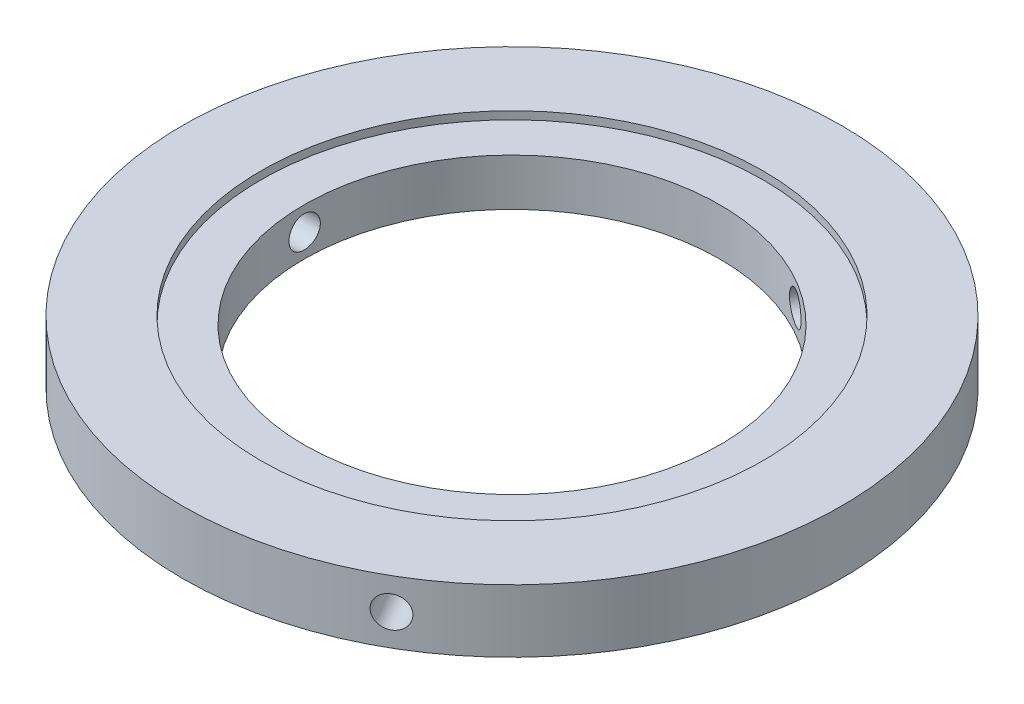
ISO-10303-21;
HEADER;
FILE_DESCRIPTION(('STEP AP214'),'2;1');
FILE_NAME('part.step','',(''),(''),'','','');
FILE_SCHEMA(('AUTOMOTIVE_DESIGN { 1 0 10303 214 1 1 1 1 }'));
ENDSEC;
DATA;
#1=APPLICATION_CONTEXT('core data for automotive mechanical design processes');
#2=APPLICATION_PROTOCOL_DEFINITION('international standard','automotive_design',2000,#1);
#3=PRODUCT_CONTEXT('',#1,'mechanical');
#4=PRODUCT('Part','Part','',(#3));
#5=PRODUCT_RELATED_PRODUCT_CATEGORY('part','',(#4));
#6=PRODUCT_DEFINITION_FORMATION('','',#4);
#7=PRODUCT_DEFINITION_CONTEXT('part definition',#1,'design');
#8=PRODUCT_DEFINITION('design','',#6,#7);
#9=PRODUCT_DEFINITION_SHAPE('','',#8);
#10=(LENGTH_UNIT() NAMED_UNIT(*) SI_UNIT(.MILLI.,.METRE.));
#11=(NAMED_UNIT(*) PLANE_ANGLE_UNIT() SI_UNIT($,.RADIAN.));
#12=(NAMED_UNIT(*) SI_UNIT($,.STERADIAN.) SOLID_ANGLE_UNIT());
#13=UNCERTAINTY_MEASURE_WITH_UNIT(LENGTH_MEASURE(1.E-05),#10,'distance_accuracy_value','');
#14=(GEOMETRIC_REPRESENTATION_CONTEXT(3) GLOBAL_UNCERTAINTY_ASSIGNED_CONTEXT((#13)) GLOBAL_UNIT_ASSIGNED_CONTEXT((#10,
#11,#12)) REPRESENTATION_CONTEXT('',''));
#15=CARTESIAN_POINT('',(0.,0.,0.));
#16=DIRECTION('',(0.,0.,1.));
#17=DIRECTION('',(1.,0.,0.));
#18=AXIS2_PLACEMENT_3D('',#15,#16,#17);
#19=CARTESIAN_POINT('',(0.,4.,0.));
#20=DIRECTION('',(0.,1.,0.));
#21=DIRECTION('',(0.,0.,1.));
#22=AXIS2_PLACEMENT_3D('',#19,#20,#21);
#23=CYLINDRICAL_SURFACE('',#22,13.25);
#24=CARTESIAN_POINT('',(0.,3.5,0.));
#25=DIRECTION('',(0.,1.,0.));
#26=DIRECTION('',(0.,0.,1.));
#27=AXIS2_PLACEMENT_3D('',#24,#25,#26);
#28=CIRCLE('',#27,13.25);
#29=CARTESIAN_POINT('',(0.,3.5,13.25));
#30=VERTEX_POINT('',#29);
#31=EDGE_CURVE('E91',#30,#30,#28,.F.);
#32=ORIENTED_EDGE('',*,*,#31,.F.);
#33=EDGE_LOOP('',(#32));
#34=FACE_BOUND('',#33,.T.);
#35=CARTESIAN_POINT('',(7.47213053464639,2.,-10.9421097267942));
#36=CARTESIAN_POINT('',(7.47212865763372,1.94391544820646,-10.9421113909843));
#37=CARTESIAN_POINT('',(7.46821117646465,1.88779226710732,-10.9447893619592));
#38=CARTESIAN_POINT('',(7.45262579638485,1.77709746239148,-10.9554075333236));
#39=CARTESIAN_POINT('',(7.44094901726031,1.72252769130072,-10.9633537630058));
#40=CARTESIAN_POINT('',(7.41013943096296,1.61655904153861,-10.9842012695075));
#41=CARTESIAN_POINT('',(7.391010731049,1.56515843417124,-10.9970998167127));
#42=CARTESIAN_POINT('',(7.34577972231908,1.46696269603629,-11.0273640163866));
#43=CARTESIAN_POINT('',(7.31967894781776,1.42016655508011,-11.0447286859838));
#44=CARTESIAN_POINT('',(7.26110067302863,1.33239572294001,-11.0833273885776));
#45=CARTESIAN_POINT('',(7.22861124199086,1.29143217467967,-11.1045686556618));
#46=CARTESIAN_POINT('',(7.15811125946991,1.21658493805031,-11.1501435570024));
#47=CARTESIAN_POINT('',(7.12010047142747,1.18270155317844,-11.1744773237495));
#48=CARTESIAN_POINT('',(7.0394944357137,1.12294032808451,-11.225430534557));
#49=CARTESIAN_POINT('',(6.99689382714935,1.09707198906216,-11.252052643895));
#50=CARTESIAN_POINT('',(6.90827802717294,1.05413595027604,-11.3066750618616));
#51=CARTESIAN_POINT('',(6.86226288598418,1.03706812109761,-11.334675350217));
#52=CARTESIAN_POINT('',(6.76816591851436,1.01224928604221,-11.3911119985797));
#53=CARTESIAN_POINT('',(6.72008823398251,1.00448043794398,-11.4195474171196));
#54=CARTESIAN_POINT('',(6.62312885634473,0.9984249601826,-11.476053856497));
#55=CARTESIAN_POINT('',(6.57424717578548,1.00013818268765,-11.5041248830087));
#56=CARTESIAN_POINT('',(6.47717812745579,1.01298357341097,-11.5590556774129));
#57=CARTESIAN_POINT('',(6.42898954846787,1.02409655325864,-11.5859177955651));
#58=CARTESIAN_POINT('',(6.33460449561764,1.05539618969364,-11.6377913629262));
#59=CARTESIAN_POINT('',(6.28840803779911,1.07558291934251,-11.6628027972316));
#60=CARTESIAN_POINT('',(6.19932476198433,1.12447855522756,-11.7103982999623));
#61=CARTESIAN_POINT('',(6.15644135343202,1.15319609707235,-11.7329798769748));
#62=CARTESIAN_POINT('',(6.07532041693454,1.21833189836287,-11.7751890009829));
#63=CARTESIAN_POINT('',(6.03708296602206,1.25475028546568,-11.7948164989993));
#64=CARTESIAN_POINT('',(5.96632829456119,1.33436223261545,-11.8307653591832));
#65=CARTESIAN_POINT('',(5.9338255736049,1.37757245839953,-11.847078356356));
#66=CARTESIAN_POINT('',(5.87566711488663,1.46948329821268,-11.8760302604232));
#67=CARTESIAN_POINT('',(5.85001138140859,1.51818391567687,-11.8886691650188));
#68=CARTESIAN_POINT('',(5.80635554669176,1.61970440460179,-11.9100515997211));
#69=CARTESIAN_POINT('',(5.78835616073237,1.67252466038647,-11.9187947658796));
#70=CARTESIAN_POINT('',(5.76059533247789,1.78077974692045,-11.9322370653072));
#71=CARTESIAN_POINT('',(5.75083374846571,1.83621453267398,-11.9369362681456));
#72=CARTESIAN_POINT('',(5.73987908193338,1.9479788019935,-11.9422077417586));
#73=CARTESIAN_POINT('',(5.73866493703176,2.00430574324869,-11.9427901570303));
#74=CARTESIAN_POINT('',(5.7447888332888,2.11638395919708,-11.9398455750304));
#75=CARTESIAN_POINT('',(5.75212680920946,2.17213523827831,-11.9363186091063));
#76=CARTESIAN_POINT('',(5.77510314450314,2.28141304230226,-11.9252188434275));
#77=CARTESIAN_POINT('',(5.79073175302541,2.33494210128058,-11.9176507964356));
#78=CARTESIAN_POINT('',(5.82978277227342,2.43833435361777,-11.8985966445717));
#79=CARTESIAN_POINT('',(5.85320528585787,2.48819749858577,-11.8871104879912));
#80=CARTESIAN_POINT('',(5.90715830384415,2.58294934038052,-11.860391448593));
#81=CARTESIAN_POINT('',(5.93770259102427,2.62782813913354,-11.8451512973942));
#82=CARTESIAN_POINT('',(6.00492415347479,2.71123744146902,-11.8112150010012));
#83=CARTESIAN_POINT('',(6.04160151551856,2.74976785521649,-11.7925188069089));
#84=CARTESIAN_POINT('',(6.12004727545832,2.81946588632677,-11.7519985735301));
#85=CARTESIAN_POINT('',(6.16182586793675,2.85061838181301,-11.7301682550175));
#86=CARTESIAN_POINT('',(6.24915026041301,2.90457263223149,-11.6838803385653));
#87=CARTESIAN_POINT('',(6.29469602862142,2.9273744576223,-11.6594227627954));
#88=CARTESIAN_POINT('',(6.38814658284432,2.96395399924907,-11.6084843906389));
#89=CARTESIAN_POINT('',(6.43604884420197,2.97774115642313,-11.5820057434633));
#90=CARTESIAN_POINT('',(6.53284978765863,2.99593086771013,-11.527682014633));
#91=CARTESIAN_POINT('',(6.58174845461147,3.00033356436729,-11.4998369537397));
#92=CARTESIAN_POINT('',(6.67901076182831,2.99962784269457,-11.4436210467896));
#93=CARTESIAN_POINT('',(6.72737542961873,2.99454303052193,-11.415251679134));
#94=CARTESIAN_POINT('',(6.82233566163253,2.97505574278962,-11.3587538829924));
#95=CARTESIAN_POINT('',(6.86893122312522,2.96065325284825,-11.3306254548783));
#96=CARTESIAN_POINT('',(6.95907711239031,2.92294519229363,-11.2754840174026));
#97=CARTESIAN_POINT('',(7.00262754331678,2.89963992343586,-11.24847097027));
#98=CARTESIAN_POINT('',(7.08552576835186,2.84479072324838,-11.196437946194));
#99=CARTESIAN_POINT('',(7.12487364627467,2.81324695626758,-11.1714179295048));
#100=CARTESIAN_POINT('',(7.19843496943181,2.74272783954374,-11.1241607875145));
#101=CARTESIAN_POINT('',(7.23263607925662,2.70373512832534,-11.1019303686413));
#102=CARTESIAN_POINT('',(7.29492687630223,2.61945410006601,-11.0610999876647));
#103=CARTESIAN_POINT('',(7.323015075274,2.57416425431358,-11.0425009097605));
#104=CARTESIAN_POINT('',(7.37240038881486,2.47850170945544,-11.0095911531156));
#105=CARTESIAN_POINT('',(7.39368649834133,2.42812094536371,-10.9952874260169));
#106=CARTESIAN_POINT('',(7.42885165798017,2.32380064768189,-10.971559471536));
#107=CARTESIAN_POINT('',(7.44273928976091,2.26986531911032,-10.9621295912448));
#108=CARTESIAN_POINT('',(7.45919967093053,2.1796723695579,-10.9509313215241));
#109=CARTESIAN_POINT('',(7.46404308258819,2.14399608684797,-10.9476288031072));
#110=CARTESIAN_POINT('',(7.47050911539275,2.07221854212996,-10.9432174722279));
#111=CARTESIAN_POINT('',(7.47213174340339,2.03611728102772,-10.9421086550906));
#112=CARTESIAN_POINT('',(7.47213053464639,2.,-10.9421097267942));
#113=B_SPLINE_CURVE_WITH_KNOTS('',3,(#35,#36,#37,#38,#39,#40,#41,#42,#43,#44,#45,#46,#47,#48,
#49,#50,#51,#52,#53,#54,#55,#56,#57,#58,#59,#60,#61,#62,#63,#64,#65,#66,#67,#68,#69,#70,#71,#72,
#73,#74,#75,#76,#77,#78,#79,#80,#81,#82,#83,#84,#85,#86,#87,#88,#89,#90,#91,#92,#93,#94,#95,#96,
#97,#98,#99,#100,#101,#102,#103,#104,#105,#106,#107,#108,#109,#110,#111,#112),.UNSPECIFIED.,.T.,
.F.,(4,2,2,2,2,2,2,2,2,2,2,2,2,2,2,2,2,2,2,2,2,2,2,2,2,2,2,2,2,2,2,2,2,2,2,2,2,2,4),(0.,
0.16812179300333,0.336436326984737,0.504658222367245,0.672843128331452,0.841345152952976,
1.00985439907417,1.17856264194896,1.34726840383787,1.51564994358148,1.68402885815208,
1.85206487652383,2.02010224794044,2.18831030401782,2.35652114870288,2.52515138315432,
2.69378172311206,2.86242781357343,3.03107100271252,3.19929847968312,3.36752467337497,
3.53555344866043,3.70358444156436,3.87194336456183,4.04030466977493,4.20900812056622,
4.37771014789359,4.54623521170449,4.71475771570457,4.88286147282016,5.05096548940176,
5.21906380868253,5.38715877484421,5.55565041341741,5.72418302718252,5.89298694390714,
6.06159463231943,6.16986178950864,6.27812871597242),.UNSPECIFIED.);
#114=CARTESIAN_POINT('',(7.47213053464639,2.,-10.9421097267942));
#115=VERTEX_POINT('',#114);
#116=EDGE_CURVE('E132',#115,#115,#113,.T.);
#117=ORIENTED_EDGE('',*,*,#116,.T.);
#118=EDGE_LOOP('',(#117));
#119=FACE_BOUND('',#118,.T.);
#120=CARTESIAN_POINT('',(5.74007972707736,2.,11.9421097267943));
#121=CARTESIAN_POINT('',(5.74008210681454,1.94391544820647,11.9421089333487));
#122=CARTESIAN_POINT('',(5.74436003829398,1.88779226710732,11.9400552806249));
#123=CARTESIAN_POINT('',(5.76134833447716,1.77709746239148,11.9318670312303));
#124=CARTESIAN_POINT('',(5.77406836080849,1.72252769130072,11.9257277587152));
#125=CARTESIAN_POINT('',(5.80752762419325,1.61655904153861,11.9094696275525));
#126=CARTESIAN_POINT('',(5.82826244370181,1.56515843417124,11.8993529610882));
#127=CARTESIAN_POINT('',(5.87708751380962,1.46696269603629,11.8753138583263));
#128=CARTESIAN_POINT('',(5.90517614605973,1.42016655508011,11.8613922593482));
#129=CARTESIAN_POINT('',(5.96789274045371,1.33239572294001,11.8299613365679));
#130=CARTESIAN_POINT('',(6.00253293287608,1.29143217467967,11.8124452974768));
#131=CARTESIAN_POINT('',(6.07725194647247,1.21658493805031,11.7741779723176));
#132=CARTESIAN_POINT('',(6.11733100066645,1.18270155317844,11.7534265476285));
#133=CARTESIAN_POINT('',(6.20176079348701,1.12294032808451,11.7090962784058));
#134=CARTESIAN_POINT('',(6.24611652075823,1.09707198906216,11.6855141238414));
#135=CARTESIAN_POINT('',(6.33772882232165,1.05413595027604,11.6360817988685));
#136=CARTESIAN_POINT('',(6.38498535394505,1.03706812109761,11.6102316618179));
#137=CARTESIAN_POINT('',(6.48090940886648,1.01224928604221,11.5569596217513));
#138=CARTESIAN_POINT('',(6.52957404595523,1.00448043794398,11.5295408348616));
#139=CARTESIAN_POINT('',(6.62698974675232,0.9984249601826,11.4738247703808));
#140=CARTESIAN_POINT('',(6.67574080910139,1.00013818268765,11.4455275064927));
#141=CARTESIAN_POINT('',(6.77184679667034,1.01298357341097,11.3889286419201));
#142=CARTESIAN_POINT('',(6.81920436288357,1.02409655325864,11.3606271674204));
#143=CARTESIAN_POINT('',(6.91132071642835,1.05539618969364,11.3048240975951));
#144=CARTESIAN_POINT('',(6.95607948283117,1.07558291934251,11.2773225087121));
#145=CARTESIAN_POINT('',(7.04184003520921,1.12447855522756,11.2239718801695));
#146=CARTESIAN_POINT('',(7.08283795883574,1.15319609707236,11.1981245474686));
#147=CARTESIAN_POINT('',(7.15995260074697,1.21833189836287,11.1489763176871));
#148=CARTESIAN_POINT('',(7.19606923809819,1.25475028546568,11.1256754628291));
#149=CARTESIAN_POINT('',(7.26257919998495,1.33436223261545,11.0823745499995));
#150=CARTESIAN_POINT('',(7.29295803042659,1.37757245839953,11.0623828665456));
#151=CARTESIAN_POINT('',(7.34711034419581,1.46948329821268,11.0264921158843));
#152=CARTESIAN_POINT('',(7.37088382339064,1.51818391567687,11.0105930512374));
#153=CARTESIAN_POINT('',(7.411229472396,1.61970440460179,10.9834772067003));
#154=CARTESIAN_POINT('',(7.42780096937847,1.67252466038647,10.9722608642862));
#155=CARTESIAN_POINT('',(7.45332275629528,1.78077974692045,10.9549404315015));
#156=CARTESIAN_POINT('',(7.46227317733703,1.83621453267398,10.948836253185));
#157=CARTESIAN_POINT('',(7.47231574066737,1.9479788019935,10.9419849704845));
#158=CARTESIAN_POINT('',(7.4734271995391,2.00430574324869,10.9412246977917));
#159=CARTESIAN_POINT('',(7.46781516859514,2.11638395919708,10.9450558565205));
#160=CARTESIAN_POINT('',(7.46109173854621,2.17213523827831,10.9496472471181));
#161=CARTESIAN_POINT('',(7.43999089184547,2.28141304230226,10.9639954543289));
#162=CARTESIAN_POINT('',(7.42562246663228,2.33494210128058,10.973746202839));
#163=CARTESIAN_POINT('',(7.38959557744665,2.43833435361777,10.9980383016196));
#164=CARTESIAN_POINT('',(7.36793701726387,2.48819749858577,11.0125797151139));
#165=CARTESIAN_POINT('',(7.31782114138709,2.58294934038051,11.0459448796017));
#166=CARTESIAN_POINT('',(7.28935063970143,2.62782813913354,11.0647769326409));
#167=CARTESIAN_POINT('',(7.22635016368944,2.71123744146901,11.1060243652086));
#168=CARTESIAN_POINT('',(7.19182010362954,2.74976785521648,11.1284397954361));
#169=CARTESIAN_POINT('',(7.11750567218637,2.81946588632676,11.1761156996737));
#170=CARTESIAN_POINT('',(7.07771076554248,2.85061838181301,11.2013818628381));
#171=CARTESIAN_POINT('',(6.9939620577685,2.90457263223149,11.2538630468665));
#172=CARTESIAN_POINT('',(6.95000829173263,2.9273744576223,11.2810780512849));
#173=CARTESIAN_POINT('',(6.85916909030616,2.96395399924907,11.3365394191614));
#174=CARTESIAN_POINT('',(6.81228677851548,2.97774115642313,11.3647846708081));
#175=CARTESIAN_POINT('',(6.71684057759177,2.99593086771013,11.4214548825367));
#176=CARTESIAN_POINT('',(6.66827671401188,3.00033356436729,11.4498798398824));
#177=CARTESIAN_POINT('',(6.57096115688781,2.99962784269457,11.5060035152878));
#178=CARTESIAN_POINT('',(6.52221022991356,2.99454303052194,11.5337038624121));
#179=CARTESIAN_POINT('',(6.4258015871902,2.97505574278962,11.5876929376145));
#180=CARTESIAN_POINT('',(6.37814387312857,2.96065325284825,11.6139816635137));
#181=CARTESIAN_POINT('',(6.28531704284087,2.92294519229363,11.6644795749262));
#182=CARTESIAN_POINT('',(6.24014784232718,2.89963992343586,11.688688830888));
#183=CARTESIAN_POINT('',(6.15363680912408,2.84479072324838,11.734464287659));
#184=CARTESIAN_POINT('',(6.11229490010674,2.81324695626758,11.7560305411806));
#185=CARTESIAN_POINT('',(6.03458835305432,2.74272783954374,11.7961079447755));
#186=CARTESIAN_POINT('',(5.99823569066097,2.70373512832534,11.8146117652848));
#187=CARTESIAN_POINT('',(5.93173014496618,2.61945410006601,11.84814198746));
#188=CARTESIAN_POINT('',(5.90157877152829,2.57416425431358,11.863167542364));
#189=CARTESIAN_POINT('',(5.84838542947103,2.47850170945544,11.8894816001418));
#190=CARTESIAN_POINT('',(5.8253549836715,2.42812094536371,11.9007640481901));
#191=CARTESIAN_POINT('',(5.78722339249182,2.32380064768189,11.919353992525));
#192=CARTESIAN_POINT('',(5.7721130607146,2.26986531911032,11.9266660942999));
#193=CARTESIAN_POINT('',(5.75418488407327,2.17967236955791,11.9353220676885));
#194=CARTESIAN_POINT('',(5.74890311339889,2.14399608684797,11.9378653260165));
#195=CARTESIAN_POINT('',(5.74184977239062,2.07221854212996,11.9412594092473));
#196=CARTESIAN_POINT('',(5.74007819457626,2.03611728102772,11.9421102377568));
#197=CARTESIAN_POINT('',(5.74007972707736,2.,11.9421097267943));
#198=B_SPLINE_CURVE_WITH_KNOTS('',3,(#120,#121,#122,#123,#124,#125,#126,#127,#128,#129,#130,
#131,#132,#133,#134,#135,#136,#137,#138,#139,#140,#141,#142,#143,#144,#145,#146,#147,#148,#149,
#150,#151,#152,#153,#154,#155,#156,#157,#158,#159,#160,#161,#162,#163,#164,#165,#166,#167,#168,
#169,#170,#171,#172,#173,#174,#175,#176,#177,#178,#179,#180,#181,#182,#183,#184,#185,#186,#187,
#188,#189,#190,#191,#192,#193,#194,#195,#196,#197),.UNSPECIFIED.,.T.,.F.,(4,2,2,2,2,2,2,2,2,2,2,
2,2,2,2,2,2,2,2,2,2,2,2,2,2,2,2,2,2,2,2,2,2,2,2,2,2,2,4),(0.,0.16812179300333,0.336436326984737,
0.504658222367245,0.672843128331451,0.841345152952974,1.00985439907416,1.17856264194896,
1.34726840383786,1.51564994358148,1.68402885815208,1.85206487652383,2.02010224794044,
2.18831030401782,2.35652114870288,2.52515138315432,2.69378172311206,2.86242781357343,
3.03107100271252,3.19929847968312,3.36752467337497,3.53555344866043,3.70358444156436,
3.87194336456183,4.04030466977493,4.20900812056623,4.37771014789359,4.54623521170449,
4.71475771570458,4.88286147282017,5.05096548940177,5.21906380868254,5.38715877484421,
5.55565041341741,5.72418302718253,5.89298694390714,6.06159463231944,6.16986178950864,
6.27812871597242),.UNSPECIFIED.);
#199=CARTESIAN_POINT('',(5.74007972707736,2.,11.9421097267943));
#200=VERTEX_POINT('',#199);
#201=EDGE_CURVE('E60',#200,#200,#198,.T.);
#202=ORIENTED_EDGE('',*,*,#201,.T.);
#203=EDGE_LOOP('',(#202));
#204=FACE_BOUND('',#203,.T.);
#205=CARTESIAN_POINT('',(-13.2122102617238,2.,-1.));
#206=CARTESIAN_POINT('',(-13.2122107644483,1.94391544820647,-0.999997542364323));
#207=CARTESIAN_POINT('',(-13.2125712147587,1.88779226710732,-0.995265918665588));
#208=CARTESIAN_POINT('',(-13.2139741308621,1.77709746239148,-0.976459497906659));
#209=CARTESIAN_POINT('',(-13.2150173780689,1.72252769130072,-0.962373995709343));
#210=CARTESIAN_POINT('',(-13.2176670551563,1.61655904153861,-0.925268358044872));
#211=CARTESIAN_POINT('',(-13.2192731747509,1.56515843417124,-0.902253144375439));
#212=CARTESIAN_POINT('',(-13.2228672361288,1.46696269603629,-0.847949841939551));
#213=CARTESIAN_POINT('',(-13.2248550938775,1.42016655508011,-0.81666357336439));
#214=CARTESIAN_POINT('',(-13.2289934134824,1.33239572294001,-0.746633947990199));
#215=CARTESIAN_POINT('',(-13.231144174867,1.29143217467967,-0.707876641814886));
#216=CARTESIAN_POINT('',(-13.2353632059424,1.21658493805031,-0.624034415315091));
#217=CARTESIAN_POINT('',(-13.237431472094,1.18270155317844,-0.57894922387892));
#218=CARTESIAN_POINT('',(-13.2412552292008,1.12294032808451,-0.483665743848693));
#219=CARTESIAN_POINT('',(-13.2430103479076,1.09707198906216,-0.433461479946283));
#220=CARTESIAN_POINT('',(-13.2460068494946,1.05413595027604,-0.329406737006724));
#221=CARTESIAN_POINT('',(-13.2472482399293,1.03706812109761,-0.275556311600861));
#222=CARTESIAN_POINT('',(-13.2490753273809,1.01224928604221,-0.165847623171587));
#223=CARTESIAN_POINT('',(-13.2496622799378,1.00448043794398,-0.109993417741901));
#224=CARTESIAN_POINT('',(-13.2501186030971,0.998424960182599,0.00222908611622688));
#225=CARTESIAN_POINT('',(-13.2499879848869,1.00013818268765,0.0585973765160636));
#226=CARTESIAN_POINT('',(-13.2490249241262,1.01298357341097,0.170127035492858));
#227=CARTESIAN_POINT('',(-13.2481939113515,1.02409655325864,0.225290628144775));
#228=CARTESIAN_POINT('',(-13.245925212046,1.05539618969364,0.332967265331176));
#229=CARTESIAN_POINT('',(-13.2444875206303,1.07558291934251,0.385480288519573));
#230=CARTESIAN_POINT('',(-13.2411647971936,1.12447855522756,0.486426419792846));
#231=CARTESIAN_POINT('',(-13.2392793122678,1.15319609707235,0.534855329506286));
#232=CARTESIAN_POINT('',(-13.2352730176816,1.21833189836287,0.626212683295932));
#233=CARTESIAN_POINT('',(-13.2331522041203,1.25475028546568,0.669141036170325));
#234=CARTESIAN_POINT('',(-13.2289074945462,1.33436223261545,0.748390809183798));
#235=CARTESIAN_POINT('',(-13.2267836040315,1.37757245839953,0.78469548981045));
#236=CARTESIAN_POINT('',(-13.2227774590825,1.46948329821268,0.849538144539));
#237=CARTESIAN_POINT('',(-13.2208952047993,1.51818391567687,0.878076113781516));
#238=CARTESIAN_POINT('',(-13.2175850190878,1.61970440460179,0.926574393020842));
#239=CARTESIAN_POINT('',(-13.2161571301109,1.67252466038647,0.946533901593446));
#240=CARTESIAN_POINT('',(-13.2139180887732,1.78077974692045,0.977296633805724));
#241=CARTESIAN_POINT('',(-13.2131069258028,1.83621453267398,0.988100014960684));
#242=CARTESIAN_POINT('',(-13.2121948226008,1.9479788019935,1.00022277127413));
#243=CARTESIAN_POINT('',(-13.2120921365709,2.00430574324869,1.00156545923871));
#244=CARTESIAN_POINT('',(-13.212604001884,2.11638395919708,0.994789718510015));
#245=CARTESIAN_POINT('',(-13.2132185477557,2.17213523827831,0.986671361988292));
#246=CARTESIAN_POINT('',(-13.2150940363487,2.28141304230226,0.96122338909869));
#247=CARTESIAN_POINT('',(-13.2163542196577,2.33494210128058,0.943904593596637));
#248=CARTESIAN_POINT('',(-13.2193783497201,2.43833435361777,0.900558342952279));
#249=CARTESIAN_POINT('',(-13.2211423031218,2.48819749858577,0.874530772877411));
#250=CARTESIAN_POINT('',(-13.2249794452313,2.58294934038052,0.814446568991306));
#251=CARTESIAN_POINT('',(-13.2270532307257,2.62782813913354,0.780374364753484));
#252=CARTESIAN_POINT('',(-13.2312743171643,2.71123744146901,0.705190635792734));
#253=CARTESIAN_POINT('',(-13.2334216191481,2.74976785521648,0.664079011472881));
#254=CARTESIAN_POINT('',(-13.2375529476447,2.81946588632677,0.575882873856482));
#255=CARTESIAN_POINT('',(-13.2395366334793,2.85061838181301,0.528786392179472));
#256=CARTESIAN_POINT('',(-13.2431123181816,2.90457263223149,0.430017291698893));
#257=CARTESIAN_POINT('',(-13.2447043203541,2.9273744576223,0.378344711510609));
#258=CARTESIAN_POINT('',(-13.2473156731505,2.96395399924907,0.271944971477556));
#259=CARTESIAN_POINT('',(-13.2483356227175,2.97774115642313,0.217221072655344));
#260=CARTESIAN_POINT('',(-13.2496903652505,2.99593086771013,0.106227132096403));
#261=CARTESIAN_POINT('',(-13.2500251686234,3.00033356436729,0.0499571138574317));
#262=CARTESIAN_POINT('',(-13.2499719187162,2.99962784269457,-0.0623824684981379));
#263=CARTESIAN_POINT('',(-13.2495856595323,2.99454303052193,-0.118452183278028));
#264=CARTESIAN_POINT('',(-13.2481372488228,2.97505574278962,-0.228939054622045));
#265=CARTESIAN_POINT('',(-13.2470750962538,2.96065325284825,-0.283356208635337));
#266=CARTESIAN_POINT('',(-13.2443941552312,2.92294519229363,-0.388995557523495));
#267=CARTESIAN_POINT('',(-13.242775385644,2.89963992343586,-0.440217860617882));
#268=CARTESIAN_POINT('',(-13.239162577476,2.84479072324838,-0.538026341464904));
#269=CARTESIAN_POINT('',(-13.2371685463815,2.81324695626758,-0.584612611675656));
#270=CARTESIAN_POINT('',(-13.2330233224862,2.74272783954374,-0.671947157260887));
#271=CARTESIAN_POINT('',(-13.2308717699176,2.70373512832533,-0.712681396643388));
#272=CARTESIAN_POINT('',(-13.2266570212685,2.619454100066,-0.787041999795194));
#273=CARTESIAN_POINT('',(-13.2245938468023,2.57416425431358,-0.820666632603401));
#274=CARTESIAN_POINT('',(-13.2207858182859,2.47850170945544,-0.879890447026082));
#275=CARTESIAN_POINT('',(-13.2190414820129,2.42812094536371,-0.905476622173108));
#276=CARTESIAN_POINT('',(-13.216075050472,2.32380064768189,-0.947794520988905));
#277=CARTESIAN_POINT('',(-13.2148523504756,2.26986531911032,-0.964536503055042));
#278=CARTESIAN_POINT('',(-13.2133845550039,2.1796723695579,-0.98439074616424));
#279=CARTESIAN_POINT('',(-13.2129461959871,2.14399608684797,-0.990236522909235));
#280=CARTESIAN_POINT('',(-13.2123588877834,2.07221854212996,-0.998041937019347));
#281=CARTESIAN_POINT('',(-13.2122099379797,2.03611728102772,-1.00000158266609));
#282=CARTESIAN_POINT('',(-13.2122102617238,2.,-1.));
#283=B_SPLINE_CURVE_WITH_KNOTS('',3,(#205,#206,#207,#208,#209,#210,#211,#212,#213,#214,#215,
#216,#217,#218,#219,#220,#221,#222,#223,#224,#225,#226,#227,#228,#229,#230,#231,#232,#233,#234,
#235,#236,#237,#238,#239,#240,#241,#242,#243,#244,#245,#246,#247,#248,#249,#250,#251,#252,#253,
#254,#255,#256,#257,#258,#259,#260,#261,#262,#263,#264,#265,#266,#267,#268,#269,#270,#271,#272,
#273,#274,#275,#276,#277,#278,#279,#280,#281,#282),.UNSPECIFIED.,.T.,.F.,(4,2,2,2,2,2,2,2,2,2,2,
2,2,2,2,2,2,2,2,2,2,2,2,2,2,2,2,2,2,2,2,2,2,2,2,2,2,2,4),(0.,0.16812179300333,0.336436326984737,
0.504658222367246,0.672843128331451,0.841345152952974,1.00985439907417,1.17856264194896,
1.34726840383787,1.51564994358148,1.68402885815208,1.85206487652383,2.02010224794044,
2.18831030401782,2.35652114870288,2.52515138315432,2.69378172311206,2.86242781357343,
3.03107100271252,3.19929847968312,3.36752467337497,3.53555344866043,3.70358444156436,
3.87194336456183,4.04030466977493,4.20900812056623,4.37771014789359,4.54623521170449,
4.71475771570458,4.88286147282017,5.05096548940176,5.21906380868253,5.38715877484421,
5.55565041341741,5.72418302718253,5.89298694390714,6.06159463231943,6.16986178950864,
6.27812871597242),.UNSPECIFIED.);
#284=CARTESIAN_POINT('',(-13.2122102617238,2.,-1.));
#285=VERTEX_POINT('',#284);
#286=EDGE_CURVE('E45',#285,#285,#283,.T.);
#287=ORIENTED_EDGE('',*,*,#286,.T.);
#288=EDGE_LOOP('',(#287));
#289=FACE_BOUND('',#288,.T.);
#290=CARTESIAN_POINT('',(0.,0.5,0.));
#291=DIRECTION('',(0.,-1.,0.));
#292=DIRECTION('',(0.,0.,-1.));
#293=AXIS2_PLACEMENT_3D('',#290,#291,#292);
#294=CIRCLE('',#293,13.25);
#295=CARTESIAN_POINT('',(0.,0.5,-13.25));
#296=VERTEX_POINT('',#295);
#297=EDGE_CURVE('E36',#296,#296,#294,.F.);
#298=ORIENTED_EDGE('',*,*,#297,.F.);
#299=EDGE_LOOP('',(#298));
#300=FACE_BOUND('',#299,.T.);
#301=ADVANCED_FACE('F32',(#34,#119,#204,#289,#300),#23,.F.);
#302=CARTESIAN_POINT('',(0.,4.,0.));
#303=DIRECTION('',(0.,-1.,0.));
#304=DIRECTION('',(0.,0.,-1.));
#305=AXIS2_PLACEMENT_3D('',#302,#303,#304);
#306=CYLINDRICAL_SURFACE('',#305,21.);
#307=CARTESIAN_POINT('',(11.354113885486,2.,-17.6659021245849));
#308=CARTESIAN_POINT('',(11.354111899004,1.94386373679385,-17.6659036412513));
#309=CARTESIAN_POINT('',(11.3501203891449,1.88768758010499,-17.6684707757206));
#310=CARTESIAN_POINT('',(11.3342445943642,1.77688473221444,-17.6786590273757));
#311=CARTESIAN_POINT('',(11.3223509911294,1.72225994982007,-17.6862861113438));
#312=CARTESIAN_POINT('',(11.2909841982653,1.61618099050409,-17.7063271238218));
#313=CARTESIAN_POINT('',(11.2715148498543,1.56472522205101,-17.7187386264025));
#314=CARTESIAN_POINT('',(11.2255123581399,1.46643006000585,-17.7479184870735));
#315=CARTESIAN_POINT('',(11.1989808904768,1.41958957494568,-17.7646858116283));
#316=CARTESIAN_POINT('',(11.1395267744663,1.33179696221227,-17.8020272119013));
#317=CARTESIAN_POINT('',(11.1065989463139,1.29084965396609,-17.8226043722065));
#318=CARTESIAN_POINT('',(11.0352395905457,1.21604678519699,-17.8668756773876));
#319=CARTESIAN_POINT('',(10.9968078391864,1.18219151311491,-17.8905699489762));
#320=CARTESIAN_POINT('',(10.9154555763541,1.12252094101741,-17.9403205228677));
#321=CARTESIAN_POINT('',(10.8725330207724,1.09670932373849,-17.9663779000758));
#322=CARTESIAN_POINT('',(10.7833846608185,1.05388241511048,-18.0200254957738));
#323=CARTESIAN_POINT('',(10.7371588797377,1.03686706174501,-18.0476157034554));
#324=CARTESIAN_POINT('',(10.6427208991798,1.0121282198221,-18.1034664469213));
#325=CARTESIAN_POINT('',(10.5945102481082,1.00439762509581,-18.1317264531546));
#326=CARTESIAN_POINT('',(10.4974244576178,0.998425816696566,-18.1881068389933));
#327=CARTESIAN_POINT('',(10.4485493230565,1.00018453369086,-18.2162272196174));
#328=CARTESIAN_POINT('',(10.3515673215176,1.01313551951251,-18.2715124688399));
#329=CARTESIAN_POINT('',(10.3034598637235,1.02432013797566,-18.298678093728));
#330=CARTESIAN_POINT('',(10.209359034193,1.05579357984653,-18.3513459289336));
#331=CARTESIAN_POINT('',(10.1633656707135,1.07608243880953,-18.3768481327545));
#332=CARTESIAN_POINT('',(10.0748153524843,1.12519716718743,-18.4255434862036));
#333=CARTESIAN_POINT('',(10.0322598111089,1.15402652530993,-18.4487356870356));
#334=CARTESIAN_POINT('',(9.95185945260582,1.21940134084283,-18.4922304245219));
#335=CARTESIAN_POINT('',(9.91401466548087,1.25594684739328,-18.5125329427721));
#336=CARTESIAN_POINT('',(9.84412710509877,1.33575982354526,-18.5497906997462));
#337=CARTESIAN_POINT('',(9.8120901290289,1.37903393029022,-18.5667425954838));
#338=CARTESIAN_POINT('',(9.7548293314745,1.47105238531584,-18.5968910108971));
#339=CARTESIAN_POINT('',(9.72960551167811,1.51979673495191,-18.6100875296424));
#340=CARTESIAN_POINT('',(9.68673754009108,1.62137600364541,-18.6324368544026));
#341=CARTESIAN_POINT('',(9.6690936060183,1.67421104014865,-18.6415895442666));
#342=CARTESIAN_POINT('',(9.64192804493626,1.78247008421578,-18.655654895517));
#343=CARTESIAN_POINT('',(9.63240636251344,1.83789407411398,-18.6605675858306));
#344=CARTESIAN_POINT('',(9.62178435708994,1.94969945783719,-18.6660467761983));
#345=CARTESIAN_POINT('',(9.62067577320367,2.00607985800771,-18.666617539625));
#346=CARTESIAN_POINT('',(9.62689241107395,2.11824885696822,-18.6634121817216));
#347=CARTESIAN_POINT('',(9.63421760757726,2.17403745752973,-18.6596360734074));
#348=CARTESIAN_POINT('',(9.65707045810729,2.28341316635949,-18.6478190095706));
#349=CARTESIAN_POINT('',(9.67259434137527,2.33700127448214,-18.6397800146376));
#350=CARTESIAN_POINT('',(9.71136636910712,2.44048561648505,-18.6196089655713));
#351=CARTESIAN_POINT('',(9.7346145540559,2.49038183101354,-18.6074768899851));
#352=CARTESIAN_POINT('',(9.788149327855,2.58510874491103,-18.5793714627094));
#353=CARTESIAN_POINT('',(9.81844139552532,2.629935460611,-18.563395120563));
#354=CARTESIAN_POINT('',(9.88514065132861,2.71321084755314,-18.5279630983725));
#355=CARTESIAN_POINT('',(9.92154787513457,2.75165948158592,-18.5085073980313));
#356=CARTESIAN_POINT('',(9.99942203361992,2.82111846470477,-18.4665511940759));
#357=CARTESIAN_POINT('',(10.0408930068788,2.85212281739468,-18.4440482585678));
#358=CARTESIAN_POINT('',(10.1276435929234,2.90577214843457,-18.3965561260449));
#359=CARTESIAN_POINT('',(10.172923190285,2.92841716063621,-18.371566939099));
#360=CARTESIAN_POINT('',(10.2659440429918,2.96469450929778,-18.319749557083));
#361=CARTESIAN_POINT('',(10.3136842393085,2.97833068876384,-18.2929221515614));
#362=CARTESIAN_POINT('',(10.410260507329,2.9962158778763,-18.2381346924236));
#363=CARTESIAN_POINT('',(10.4590965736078,3.00046493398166,-18.2101746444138));
#364=CARTESIAN_POINT('',(10.556418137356,2.99945480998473,-18.1539304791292));
#365=CARTESIAN_POINT('',(10.6049039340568,2.99420504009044,-18.1256467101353));
#366=CARTESIAN_POINT('',(10.7002079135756,2.97436572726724,-18.0695492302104));
#367=CARTESIAN_POINT('',(10.7470260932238,2.95977616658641,-18.041735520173));
#368=CARTESIAN_POINT('',(10.837696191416,2.92167329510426,-17.9874160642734));
#369=CARTESIAN_POINT('',(10.8815480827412,2.89815990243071,-17.9609103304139));
#370=CARTESIAN_POINT('',(10.9650863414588,2.8428785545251,-17.9100328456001));
#371=CARTESIAN_POINT('',(11.0047728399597,2.81111085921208,-17.8856610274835));
#372=CARTESIAN_POINT('',(11.0789467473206,2.74018932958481,-17.8398106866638));
#373=CARTESIAN_POINT('',(11.1134295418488,2.70102900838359,-17.8183347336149));
#374=CARTESIAN_POINT('',(11.1762432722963,2.61643673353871,-17.7790034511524));
#375=CARTESIAN_POINT('',(11.204572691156,2.57100323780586,-17.7611490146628));
#376=CARTESIAN_POINT('',(11.2543421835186,2.47512119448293,-17.7296546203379));
#377=CARTESIAN_POINT('',(11.2757759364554,2.42466810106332,-17.7160185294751));
#378=CARTESIAN_POINT('',(11.3111350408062,2.32024955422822,-17.6934639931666));
#379=CARTESIAN_POINT('',(11.3250692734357,2.26628834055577,-17.6845399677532));
#380=CARTESIAN_POINT('',(11.3414063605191,2.17665919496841,-17.6740644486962));
#381=CARTESIAN_POINT('',(11.3461660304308,2.14157199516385,-17.671008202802));
#382=CARTESIAN_POINT('',(11.3525204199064,2.07099518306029,-17.6669265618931));
#383=CARTESIAN_POINT('',(11.3541151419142,2.03550557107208,-17.66590116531));
#384=CARTESIAN_POINT('',(11.354113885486,2.,-17.6659021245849));
#385=B_SPLINE_CURVE_WITH_KNOTS('',3,(#307,#308,#309,#310,#311,#312,#313,#314,#315,#316,#317,
#318,#319,#320,#321,#322,#323,#324,#325,#326,#327,#328,#329,#330,#331,#332,#333,#334,#335,#336,
#337,#338,#339,#340,#341,#342,#343,#344,#345,#346,#347,#348,#349,#350,#351,#352,#353,#354,#355,
#356,#357,#358,#359,#360,#361,#362,#363,#364,#365,#366,#367,#368,#369,#370,#371,#372,#373,#374,
#375,#376,#377,#378,#379,#380,#381,#382,#383,#384),.UNSPECIFIED.,.T.,.F.,(4,2,2,2,2,2,2,2,2,2,2,
2,2,2,2,2,2,2,2,2,2,2,2,2,2,2,2,2,2,2,2,2,2,2,2,2,2,2,4),(0.,0.168279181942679,
0.336757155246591,0.505149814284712,0.673502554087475,0.841992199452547,1.01048869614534,
1.17906222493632,1.3476345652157,1.51607780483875,1.68451981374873,1.85282524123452,
2.02113132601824,2.18950625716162,2.35788226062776,2.52642541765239,2.69496861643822,
2.86351665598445,3.03206354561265,3.20044491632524,3.36882578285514,3.5371292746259,
3.70543364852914,3.87386937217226,4.0423060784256,4.21087800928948,4.37944925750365,
4.54794854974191,4.71644700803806,4.8847786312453,5.05311057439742,5.22144406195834,
5.38977224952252,5.55824883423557,5.72676690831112,5.89543900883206,6.06391091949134,
6.17034573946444,6.27678047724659),.UNSPECIFIED.);
#386=CARTESIAN_POINT('',(11.354113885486,2.,-17.6659021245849));
#387=VERTEX_POINT('',#386);
#388=EDGE_CURVE('E81',#387,#387,#385,.T.);
#389=ORIENTED_EDGE('',*,*,#388,.F.);
#390=EDGE_LOOP('',(#389));
#391=FACE_BOUND('',#390,.T.);
#392=CARTESIAN_POINT('',(9.6220630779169,2.,18.665902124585));
#393=CARTESIAN_POINT('',(9.62206538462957,1.94386373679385,18.6659011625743));
#394=CARTESIAN_POINT('',(9.62628434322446,1.88768758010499,18.6637279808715));
#395=CARTESIAN_POINT('',(9.64304552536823,1.77688473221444,18.6550732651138));
#396=CARTESIAN_POINT('',(9.65559757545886,1.72225994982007,18.6485866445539));
#397=CARTESIAN_POINT('',(9.68863699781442,1.61618099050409,18.6314427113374));
#398=CARTESIAN_POINT('',(9.70912034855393,1.56472522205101,18.6207875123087));
#399=CARTESIAN_POINT('',(9.75739209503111,1.46643006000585,18.5955381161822));
#400=CARTESIAN_POINT('',(9.78517875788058,1.41958957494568,18.5809448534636));
#401=CARTESIAN_POINT('',(9.84724441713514,1.33179696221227,18.5481267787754));
#402=CARTESIAN_POINT('',(9.88152867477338,1.29084965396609,18.5298990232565));
#403=CARTESIAN_POINT('',(9.95554842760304,1.21604678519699,18.4902356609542));
#404=CARTESIAN_POINT('',(9.99528414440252,1.18219151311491,18.4687999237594));
#405=CARTESIAN_POINT('',(10.0790455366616,1.12252094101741,18.4232220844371));
#406=CARTESIAN_POINT('',(10.1230731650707,1.09670932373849,18.399078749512));
#407=CARTESIAN_POINT('',(10.2141075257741,1.05388241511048,18.3486978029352));
#408=CARTESIAN_POINT('',(10.2611142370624,1.03686706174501,18.3224602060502));
#409=CARTESIAN_POINT('',(10.3567013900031,1.0121282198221,18.268599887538));
#410=CARTESIAN_POINT('',(10.405280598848,1.00439762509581,18.2409782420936));
#411=CARTESIAN_POINT('',(10.5026503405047,0.998425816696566,18.1850896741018));
#412=CARTESIAN_POINT('',(10.5514408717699,1.00018453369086,18.1568227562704));
#413=CARTESIAN_POINT('',(10.6478103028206,1.01313551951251,18.1004765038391));
#414=CARTESIAN_POINT('',(10.6953901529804,1.02432013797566,18.072397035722));
#415=CARTESIAN_POINT('',(10.7880522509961,1.05579357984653,18.0172372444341));
#416=CARTESIAN_POINT('',(10.8331344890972,1.07608243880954,17.9901569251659));
#417=CARTESIAN_POINT('',(10.9195810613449,1.12519716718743,17.9378177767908));
#418=CARTESIAN_POINT('',(10.9609438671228,1.15402652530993,17.9125596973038));
#419=CARTESIAN_POINT('',(11.0388115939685,1.21940134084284,17.8646783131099));
#420=CARTESIAN_POINT('',(11.0753164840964,1.25594684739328,17.842055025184));
#421=CARTESIAN_POINT('',(11.1425264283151,1.33575982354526,17.8001595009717));
#422=CARTESIAN_POINT('',(11.1732256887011,1.37903393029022,17.7808906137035));
#423=CARTESIAN_POINT('',(11.2279653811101,1.47105238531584,17.7463755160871));
#424=CARTESIAN_POINT('',(11.2520058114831,1.5197967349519,17.7311293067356));
#425=CARTESIAN_POINT('',(11.2927948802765,1.62137600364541,17.7051792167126));
#426=CARTESIAN_POINT('',(11.309543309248,1.67421104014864,17.6944754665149));
#427=CARTESIAN_POINT('',(11.335307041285,1.78247008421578,17.677982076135));
#428=CARTESIAN_POINT('',(11.3443223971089,1.83789407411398,17.6721924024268));
#429=CARTESIAN_POINT('',(11.3543785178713,1.94969945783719,17.6657330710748));
#430=CARTESIAN_POINT('',(11.3554271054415,2.00607985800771,17.6650583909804));
#431=CARTESIAN_POINT('',(11.3495428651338,2.11824885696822,17.6688394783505));
#432=CARTESIAN_POINT('',(11.3426100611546,2.17403745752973,17.673295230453));
#433=CARTESIAN_POINT('',(11.3209497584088,2.28341316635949,17.6871778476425));
#434=CARTESIAN_POINT('',(11.3062258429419,2.33700127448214,17.6966024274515));
#435=CARTESIAN_POINT('',(11.2693711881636,2.44048561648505,17.7200944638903));
#436=CARTESIAN_POINT('',(11.2472404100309,2.49038183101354,17.7341619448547));
#437=CARTESIAN_POINT('',(11.1961330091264,2.58510874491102,17.7664717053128));
#438=CARTESIAN_POINT('',(11.1671510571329,2.629935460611,17.7847172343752));
#439=CARTESIAN_POINT('',(11.1031163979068,2.71321084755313,17.8247644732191));
#440=CARTESIAN_POINT('',(11.06806365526,2.75165948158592,17.8465662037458));
#441=CARTESIAN_POINT('',(10.9927914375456,2.82111846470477,17.8930291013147));
#442=CARTESIAN_POINT('',(10.9525678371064,2.85212281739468,17.9176925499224));
#443=CARTESIAN_POINT('',(10.8680631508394,2.90577214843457,17.9690746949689));
#444=CARTESIAN_POINT('',(10.8237820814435,2.92841716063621,17.9957933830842));
#445=CARTESIAN_POINT('',(10.7323964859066,2.96469450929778,18.050443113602));
#446=CARTESIAN_POINT('',(10.6852931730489,2.97833068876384,18.0783736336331));
#447=CARTESIAN_POINT('',(10.5895577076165,2.9962158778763,18.1346174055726));
#448=CARTESIAN_POINT('',(10.5409255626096,3.00046493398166,18.1629306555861));
#449=CARTESIAN_POINT('',(10.4435559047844,2.99945480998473,18.2190915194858));
#450=CARTESIAN_POINT('',(10.3948185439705,2.99420504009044,18.2469395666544));
#451=CARTESIAN_POINT('',(10.2985847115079,2.97436572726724,18.301426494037));
#452=CARTESIAN_POINT('',(10.2510882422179,2.95977616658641,18.3280653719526));
#453=CARTESIAN_POINT('',(10.158711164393,2.92167329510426,18.3794282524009));
#454=CARTESIAN_POINT('',(10.1138305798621,2.89815990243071,18.4041522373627));
#455=CARTESIAN_POINT('',(10.0280002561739,2.8428785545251,18.4510597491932));
#456=CARTESIAN_POINT('',(9.98705039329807,2.81111085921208,18.473243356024));
#457=CARTESIAN_POINT('',(9.91025587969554,2.74018932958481,18.5145546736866));
#458=CARTESIAN_POINT('',(9.87441576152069,2.70102900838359,18.533679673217));
#459=CARTESIAN_POINT('',(9.80894700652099,2.61643673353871,18.5684123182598));
#460=CARTESIAN_POINT('',(9.77931990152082,2.57100323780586,18.5840190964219));
#461=CARTESIAN_POINT('',(9.7271602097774,2.47512119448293,18.611373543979));
#462=CARTESIAN_POINT('',(9.70463413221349,2.42466810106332,18.6231176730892));
#463=CARTESIAN_POINT('',(9.66742177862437,2.32024955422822,18.6424622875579));
#464=CARTESIAN_POINT('',(9.65272622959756,2.26628834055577,18.6500676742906));
#465=CARTESIAN_POINT('',(9.63548562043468,2.17665919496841,18.6589782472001));
#466=CARTESIAN_POINT('',(9.63045899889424,2.14157199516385,18.6615721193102));
#467=CARTESIAN_POINT('',(9.6237469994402,2.07099518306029,18.6650343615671));
#468=CARTESIAN_POINT('',(9.62206161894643,2.03550557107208,18.6659027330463));
#469=CARTESIAN_POINT('',(9.6220630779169,2.,18.665902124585));
#470=B_SPLINE_CURVE_WITH_KNOTS('',3,(#392,#393,#394,#395,#396,#397,#398,#399,#400,#401,#402,
#403,#404,#405,#406,#407,#408,#409,#410,#411,#412,#413,#414,#415,#416,#417,#418,#419,#420,#421,
#422,#423,#424,#425,#426,#427,#428,#429,#430,#431,#432,#433,#434,#435,#436,#437,#438,#439,#440,
#441,#442,#443,#444,#445,#446,#447,#448,#449,#450,#451,#452,#453,#454,#455,#456,#457,#458,#459,
#460,#461,#462,#463,#464,#465,#466,#467,#468,#469),.UNSPECIFIED.,.T.,.F.,(4,2,2,2,2,2,2,2,2,2,2,
2,2,2,2,2,2,2,2,2,2,2,2,2,2,2,2,2,2,2,2,2,2,2,2,2,2,2,4),(0.,0.16827918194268,0.336757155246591,
0.50514981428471,0.673502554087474,0.841992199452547,1.01048869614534,1.17906222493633,
1.3476345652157,1.51607780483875,1.68451981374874,1.85282524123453,2.02113132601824,
2.18950625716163,2.35788226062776,2.52642541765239,2.69496861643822,2.86351665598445,
3.03206354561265,3.20044491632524,3.36882578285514,3.5371292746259,3.70543364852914,
3.87386937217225,4.04230607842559,4.21087800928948,4.37944925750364,4.54794854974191,
4.71644700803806,4.8847786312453,5.05311057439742,5.22144406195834,5.38977224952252,
5.55824883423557,5.72676690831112,5.89543900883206,6.06391091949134,6.17034573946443,
6.27678047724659),.UNSPECIFIED.);
#471=CARTESIAN_POINT('',(9.6220630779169,2.,18.665902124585));
#472=VERTEX_POINT('',#471);
#473=EDGE_CURVE('E86',#472,#472,#470,.T.);
#474=ORIENTED_EDGE('',*,*,#473,.F.);
#475=EDGE_LOOP('',(#474));
#476=FACE_BOUND('',#475,.T.);
#477=CARTESIAN_POINT('',(-20.976176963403,2.,-1.));
#478=CARTESIAN_POINT('',(-20.9761772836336,1.94386373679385,-0.999997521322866));
#479=CARTESIAN_POINT('',(-20.9764047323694,1.88768758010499,-0.995257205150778));
#480=CARTESIAN_POINT('',(-20.9772901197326,1.77688473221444,-0.976414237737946));
#481=CARTESIAN_POINT('',(-20.9779485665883,1.72225994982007,-0.962300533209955));
#482=CARTESIAN_POINT('',(-20.9796211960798,1.61618099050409,-0.925115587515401));
#483=CARTESIAN_POINT('',(-20.9806351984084,1.56472522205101,-0.902048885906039));
#484=CARTESIAN_POINT('',(-20.9829044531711,1.46643006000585,-0.847619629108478));
#485=CARTESIAN_POINT('',(-20.9841596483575,1.41958957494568,-0.816259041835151));
#486=CARTESIAN_POINT('',(-20.9867711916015,1.33179696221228,-0.746099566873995));
#487=CARTESIAN_POINT('',(-20.9881276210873,1.29084965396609,-0.707294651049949));
#488=CARTESIAN_POINT('',(-20.9907880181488,1.21604678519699,-0.623359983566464));
#489=CARTESIAN_POINT('',(-20.992091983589,1.18219151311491,-0.57822997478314));
#490=CARTESIAN_POINT('',(-20.9945011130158,1.12252094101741,-0.482901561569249));
#491=CARTESIAN_POINT('',(-20.9956061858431,1.09670932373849,-0.432700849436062));
#492=CARTESIAN_POINT('',(-20.9974921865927,1.05388241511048,-0.328672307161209));
#493=CARTESIAN_POINT('',(-20.9982731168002,1.03686706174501,-0.274844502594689));
#494=CARTESIAN_POINT('',(-20.999422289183,1.0121282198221,-0.165133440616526));
#495=CARTESIAN_POINT('',(-20.9997908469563,1.00439762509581,-0.109251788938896));
#496=CARTESIAN_POINT('',(-21.0000747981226,0.998425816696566,0.00301716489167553));
#497=CARTESIAN_POINT('',(-20.9999901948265,1.00018453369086,0.0594044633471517));
#498=CARTESIAN_POINT('',(-20.9993776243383,1.01313551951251,0.171035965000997));
#499=CARTESIAN_POINT('',(-20.998850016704,1.02432013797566,0.226281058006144));
#500=CARTESIAN_POINT('',(-20.9974112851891,1.05579357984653,0.334108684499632));
#501=CARTESIAN_POINT('',(-20.9965001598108,1.07608243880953,0.386691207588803));
#502=CARTESIAN_POINT('',(-20.9943964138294,1.12519716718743,0.487725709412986));
#503=CARTESIAN_POINT('',(-20.9932036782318,1.15402652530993,0.536175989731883));
#504=CARTESIAN_POINT('',(-20.9906710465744,1.21940134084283,0.62755211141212));
#505=CARTESIAN_POINT('',(-20.9893311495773,1.25594684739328,0.67047791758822));
#506=CARTESIAN_POINT('',(-20.9866535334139,1.33575982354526,0.749631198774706));
#507=CARTESIAN_POINT('',(-20.9853158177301,1.37903393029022,0.785851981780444));
#508=CARTESIAN_POINT('',(-20.9827947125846,1.47105238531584,0.850515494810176));
#509=CARTESIAN_POINT('',(-20.9816113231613,1.5197967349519,0.878958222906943));
#510=CARTESIAN_POINT('',(-20.9795324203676,1.62137600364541,0.927257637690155));
#511=CARTESIAN_POINT('',(-20.9786369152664,1.67421104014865,0.947114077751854));
#512=CARTESIAN_POINT('',(-20.9772350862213,1.78247008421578,0.977672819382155));
#513=CARTESIAN_POINT('',(-20.9767287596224,1.83789407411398,0.988375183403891));
#514=CARTESIAN_POINT('',(-20.9761628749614,1.94969945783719,1.00031370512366));
#515=CARTESIAN_POINT('',(-20.9761028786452,2.00607985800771,1.0015591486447));
#516=CARTESIAN_POINT('',(-20.9764352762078,2.11824885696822,0.99457270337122));
#517=CARTESIAN_POINT('',(-20.976827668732,2.17403745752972,0.986340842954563));
#518=CARTESIAN_POINT('',(-20.9780202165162,2.28341316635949,0.960641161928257));
#519=CARTESIAN_POINT('',(-20.9788201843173,2.33700127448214,0.94317758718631));
#520=CARTESIAN_POINT('',(-20.9807375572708,2.44048561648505,0.899514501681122));
#521=CARTESIAN_POINT('',(-20.9818549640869,2.49038183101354,0.873314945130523));
#522=CARTESIAN_POINT('',(-20.9842823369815,2.58510874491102,0.812899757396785));
#523=CARTESIAN_POINT('',(-20.9855924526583,2.629935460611,0.778677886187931));
#524=CARTESIAN_POINT('',(-20.9882570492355,2.71321084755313,0.7031986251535));
#525=CARTESIAN_POINT('',(-20.9896115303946,2.75165948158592,0.661941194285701));
#526=CARTESIAN_POINT('',(-20.9922134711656,2.82111846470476,0.573522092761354));
#527=CARTESIAN_POINT('',(-20.9934608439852,2.85212281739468,0.526355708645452));
#528=CARTESIAN_POINT('',(-20.9957067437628,2.90577214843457,0.427481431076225));
#529=CARTESIAN_POINT('',(-20.9967052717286,2.92841716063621,0.375773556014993));
#530=CARTESIAN_POINT('',(-20.9983405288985,2.96469450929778,0.269306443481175));
#531=CARTESIAN_POINT('',(-20.9989774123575,2.97833068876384,0.214548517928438));
#532=CARTESIAN_POINT('',(-20.9998182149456,2.9962158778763,0.103517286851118));
#533=CARTESIAN_POINT('',(-21.0000221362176,3.00046493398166,0.0472439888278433));
#534=CARTESIAN_POINT('',(-20.9999740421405,2.99945480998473,-0.0651610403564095));
#535=CARTESIAN_POINT('',(-20.9997224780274,2.99420504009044,-0.121292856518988));
#536=CARTESIAN_POINT('',(-20.9987926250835,2.97436572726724,-0.231877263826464));
#537=CARTESIAN_POINT('',(-20.9981143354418,2.95977616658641,-0.286329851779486));
#538=CARTESIAN_POINT('',(-20.9964073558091,2.92167329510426,-0.39201218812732));
#539=CARTESIAN_POINT('',(-20.9953786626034,2.89815990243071,-0.4432419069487));
#540=CARTESIAN_POINT('',(-20.9930865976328,2.8428785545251,-0.541026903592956));
#541=CARTESIAN_POINT('',(-20.9918232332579,2.81111085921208,-0.587582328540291));
#542=CARTESIAN_POINT('',(-20.9892026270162,2.74018932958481,-0.674743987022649));
#543=CARTESIAN_POINT('',(-20.9878453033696,2.70102900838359,-0.715344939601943));
#544=CARTESIAN_POINT('',(-20.9851902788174,2.61643673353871,-0.789408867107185));
#545=CARTESIAN_POINT('',(-20.9838925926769,2.57100323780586,-0.82287008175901));
#546=CARTESIAN_POINT('',(-20.9815023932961,2.47512119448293,-0.881718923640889));
#547=CARTESIAN_POINT('',(-20.980410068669,2.42466810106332,-0.907099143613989));
#548=CARTESIAN_POINT('',(-20.9785568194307,2.32024955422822,-0.948998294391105));
#549=CARTESIAN_POINT('',(-20.9777955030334,2.26628834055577,-0.965527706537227));
#550=CARTESIAN_POINT('',(-20.9768919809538,2.17665919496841,-0.984913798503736));
#551=CARTESIAN_POINT('',(-20.9766250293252,2.14157199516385,-0.990563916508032));
#552=CARTESIAN_POINT('',(-20.9762674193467,2.07099518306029,-0.99810779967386));
#553=CARTESIAN_POINT('',(-20.9761767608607,2.03550557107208,-1.00000156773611));
#554=CARTESIAN_POINT('',(-20.976176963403,2.,-1.));
#555=B_SPLINE_CURVE_WITH_KNOTS('',3,(#477,#478,#479,#480,#481,#482,#483,#484,#485,#486,#487,
#488,#489,#490,#491,#492,#493,#494,#495,#496,#497,#498,#499,#500,#501,#502,#503,#504,#505,#506,
#507,#508,#509,#510,#511,#512,#513,#514,#515,#516,#517,#518,#519,#520,#521,#522,#523,#524,#525,
#526,#527,#528,#529,#530,#531,#532,#533,#534,#535,#536,#537,#538,#539,#540,#541,#542,#543,#544,
#545,#546,#547,#548,#549,#550,#551,#552,#553,#554),.UNSPECIFIED.,.T.,.F.,(4,2,2,2,2,2,2,2,2,2,2,
2,2,2,2,2,2,2,2,2,2,2,2,2,2,2,2,2,2,2,2,2,2,2,2,2,2,2,4),(0.,0.16827918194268,0.336757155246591,
0.505149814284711,0.673502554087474,0.841992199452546,1.01048869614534,1.17906222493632,
1.3476345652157,1.51607780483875,1.68451981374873,1.85282524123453,2.02113132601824,
2.18950625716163,2.35788226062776,2.52642541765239,2.69496861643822,2.86351665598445,
3.03206354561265,3.20044491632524,3.36882578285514,3.5371292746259,3.70543364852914,
3.87386937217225,4.04230607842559,4.21087800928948,4.37944925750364,4.54794854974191,
4.71644700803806,4.8847786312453,5.05311057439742,5.22144406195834,5.38977224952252,
5.55824883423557,5.72676690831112,5.89543900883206,6.06391091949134,6.17034573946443,
6.27678047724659),.UNSPECIFIED.);
#556=CARTESIAN_POINT('',(-20.976176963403,2.,-1.));
#557=VERTEX_POINT('',#556);
#558=EDGE_CURVE('E48',#557,#557,#555,.T.);
#559=ORIENTED_EDGE('',*,*,#558,.F.);
#560=EDGE_LOOP('',(#559));
#561=FACE_BOUND('',#560,.T.);
#562=CARTESIAN_POINT('',(0.,4.,0.));
#563=DIRECTION('',(0.,1.,0.));
#564=DIRECTION('',(0.,0.,1.));
#565=AXIS2_PLACEMENT_3D('',#562,#563,#564);
#566=CIRCLE('',#565,21.);
#567=CARTESIAN_POINT('',(0.,4.,21.));
#568=VERTEX_POINT('',#567);
#569=EDGE_CURVE('E10',#568,#568,#566,.T.);
#570=ORIENTED_EDGE('',*,*,#569,.F.);
#571=EDGE_LOOP('',(#570));
#572=FACE_BOUND('',#571,.T.);
#573=CARTESIAN_POINT('',(0.,0.,0.));
#574=DIRECTION('',(0.,1.,0.));
#575=DIRECTION('',(0.,0.,1.));
#576=AXIS2_PLACEMENT_3D('',#573,#574,#575);
#577=CIRCLE('',#576,21.);
#578=CARTESIAN_POINT('',(0.,0.,21.));
#579=VERTEX_POINT('',#578);
#580=EDGE_CURVE('E40',#579,#579,#577,.T.);
#581=ORIENTED_EDGE('',*,*,#580,.T.);
#582=EDGE_LOOP('',(#581));
#583=FACE_BOUND('',#582,.T.);
#584=ADVANCED_FACE('F34',(#391,#476,#561,#572,#583),#306,.T.);
#585=CARTESIAN_POINT('',(0.,4.,0.));
#586=DIRECTION('',(0.,1.,0.));
#587=DIRECTION('',(0.,0.,1.));
#588=AXIS2_PLACEMENT_3D('',#585,#586,#587);
#589=PLANE('',#588);
#590=CARTESIAN_POINT('',(0.,4.,0.));
#591=DIRECTION('',(0.,1.,0.));
#592=DIRECTION('',(0.,0.,1.));
#593=AXIS2_PLACEMENT_3D('',#590,#591,#592);
#594=CIRCLE('',#593,16.);
#595=CARTESIAN_POINT('',(0.,4.,16.));
#596=VERTEX_POINT('',#595);
#597=EDGE_CURVE('E92',#596,#596,#594,.T.);
#598=ORIENTED_EDGE('',*,*,#597,.F.);
#599=EDGE_LOOP('',(#598));
#600=FACE_BOUND('',#599,.T.);
#601=ORIENTED_EDGE('',*,*,#569,.T.);
#602=EDGE_LOOP('',(#601));
#603=FACE_BOUND('',#602,.T.);
#604=ADVANCED_FACE('F124',(#600,#603),#589,.T.);
#605=CARTESIAN_POINT('',(0.,0.,0.));
#606=DIRECTION('',(0.,1.,0.));
#607=DIRECTION('',(0.,0.,1.));
#608=AXIS2_PLACEMENT_3D('',#605,#606,#607);
#609=PLANE('',#608);
#610=CARTESIAN_POINT('',(0.,0.,0.));
#611=DIRECTION('',(0.,-1.,0.));
#612=DIRECTION('',(0.,0.,-1.));
#613=AXIS2_PLACEMENT_3D('',#610,#611,#612);
#614=CIRCLE('',#613,16.);
#615=CARTESIAN_POINT('',(0.,0.,-16.));
#616=VERTEX_POINT('',#615);
#617=EDGE_CURVE('E143',#616,#616,#614,.T.);
#618=ORIENTED_EDGE('',*,*,#617,.F.);
#619=EDGE_LOOP('',(#618));
#620=FACE_BOUND('',#619,.T.);
#621=ORIENTED_EDGE('',*,*,#580,.F.);
#622=EDGE_LOOP('',(#621));
#623=FACE_BOUND('',#622,.T.);
#624=ADVANCED_FACE('F72',(#620,#623),#609,.F.);
#625=CARTESIAN_POINT('',(-21.001,2.,0.));
#626=DIRECTION('',(1.,0.,0.));
#627=DIRECTION('',(0.,0.,-1.));
#628=AXIS2_PLACEMENT_3D('',#625,#626,#627);
#629=CYLINDRICAL_SURFACE('',#628,1.);
#630=ORIENTED_EDGE('',*,*,#558,.T.);
#631=EDGE_LOOP('',(#630));
#632=FACE_BOUND('',#631,.T.);
#633=ORIENTED_EDGE('',*,*,#286,.F.);
#634=EDGE_LOOP('',(#633));
#635=FACE_BOUND('',#634,.T.);
#636=ADVANCED_FACE('F67',(#632,#635),#629,.F.);
#637=CARTESIAN_POINT('',(14.3439497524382,2.,24.8444497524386));
#638=DIRECTION('',(-0.499999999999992,0.,-0.866025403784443));
#639=DIRECTION('',(-0.866025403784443,0.,0.499999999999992));
#640=AXIS2_PLACEMENT_3D('',#637,#638,#639);
#641=CYLINDRICAL_SURFACE('',#640,1.);
#642=ORIENTED_EDGE('',*,*,#473,.T.);
#643=EDGE_LOOP('',(#642));
#644=FACE_BOUND('',#643,.T.);
#645=ORIENTED_EDGE('',*,*,#201,.F.);
#646=EDGE_LOOP('',(#645));
#647=FACE_BOUND('',#646,.T.);
#648=ADVANCED_FACE('F71',(#644,#647),#641,.F.);
#649=CARTESIAN_POINT('',(14.3439497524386,2.,-24.8444497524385));
#650=DIRECTION('',(-0.500000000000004,0.,0.866025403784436));
#651=DIRECTION('',(0.866025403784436,0.,0.500000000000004));
#652=AXIS2_PLACEMENT_3D('',#649,#650,#651);
#653=CYLINDRICAL_SURFACE('',#652,1.);
#654=ORIENTED_EDGE('',*,*,#388,.T.);
#655=EDGE_LOOP('',(#654));
#656=FACE_BOUND('',#655,.T.);
#657=ORIENTED_EDGE('',*,*,#116,.F.);
#658=EDGE_LOOP('',(#657));
#659=FACE_BOUND('',#658,.T.);
#660=ADVANCED_FACE('F78',(#656,#659),#653,.F.);
#661=CARTESIAN_POINT('',(0.,3.5,0.));
#662=DIRECTION('',(0.,1.,0.));
#663=DIRECTION('',(0.,0.,1.));
#664=AXIS2_PLACEMENT_3D('',#661,#662,#663);
#665=PLANE('',#664);
#666=CARTESIAN_POINT('',(0.,3.5,0.));
#667=DIRECTION('',(0.,1.,0.));
#668=DIRECTION('',(0.,0.,1.));
#669=AXIS2_PLACEMENT_3D('',#666,#667,#668);
#670=CIRCLE('',#669,16.);
#671=CARTESIAN_POINT('',(0.,3.5,16.));
#672=VERTEX_POINT('',#671);
#673=EDGE_CURVE('E142',#672,#672,#670,.T.);
#674=ORIENTED_EDGE('',*,*,#673,.T.);
#675=EDGE_LOOP('',(#674));
#676=FACE_BOUND('',#675,.T.);
#677=ORIENTED_EDGE('',*,*,#31,.T.);
#678=EDGE_LOOP('',(#677));
#679=FACE_BOUND('',#678,.T.);
#680=ADVANCED_FACE('F104',(#676,#679),#665,.T.);
#681=CARTESIAN_POINT('',(0.,3.5,0.));
#682=DIRECTION('',(0.,1.,0.));
#683=DIRECTION('',(0.,0.,1.));
#684=AXIS2_PLACEMENT_3D('',#681,#682,#683);
#685=CYLINDRICAL_SURFACE('',#684,16.);
#686=ORIENTED_EDGE('',*,*,#673,.F.);
#687=EDGE_LOOP('',(#686));
#688=FACE_BOUND('',#687,.T.);
#689=ORIENTED_EDGE('',*,*,#597,.T.);
#690=EDGE_LOOP('',(#689));
#691=FACE_BOUND('',#690,.T.);
#692=ADVANCED_FACE('F99',(#688,#691),#685,.F.);
#693=CARTESIAN_POINT('',(0.,0.5,0.));
#694=DIRECTION('',(0.,-1.,0.));
#695=DIRECTION('',(0.,0.,-1.));
#696=AXIS2_PLACEMENT_3D('',#693,#694,#695);
#697=PLANE('',#696);
#698=CARTESIAN_POINT('',(0.,0.5,0.));
#699=DIRECTION('',(0.,-1.,0.));
#700=DIRECTION('',(0.,0.,-1.));
#701=AXIS2_PLACEMENT_3D('',#698,#699,#700);
#702=CIRCLE('',#701,16.);
#703=CARTESIAN_POINT('',(0.,0.5,-16.));
#704=VERTEX_POINT('',#703);
#705=EDGE_CURVE('E140',#704,#704,#702,.T.);
#706=ORIENTED_EDGE('',*,*,#705,.T.);
#707=EDGE_LOOP('',(#706));
#708=FACE_BOUND('',#707,.T.);
#709=ORIENTED_EDGE('',*,*,#297,.T.);
#710=EDGE_LOOP('',(#709));
#711=FACE_BOUND('',#710,.T.);
#712=ADVANCED_FACE('F103',(#708,#711),#697,.T.);
#713=CARTESIAN_POINT('',(0.,0.5,0.));
#714=DIRECTION('',(0.,-1.,0.));
#715=DIRECTION('',(0.,0.,-1.));
#716=AXIS2_PLACEMENT_3D('',#713,#714,#715);
#717=CYLINDRICAL_SURFACE('',#716,16.);
#718=ORIENTED_EDGE('',*,*,#705,.F.);
#719=EDGE_LOOP('',(#718));
#720=FACE_BOUND('',#719,.T.);
#721=ORIENTED_EDGE('',*,*,#617,.T.);
#722=EDGE_LOOP('',(#721));
#723=FACE_BOUND('',#722,.T.);
#724=ADVANCED_FACE('F109',(#720,#723),#717,.F.);
#725=CLOSED_SHELL('',(#301,#584,#604,#624,#636,#648,#660,#680,#692,#712,#724));
#726=MANIFOLD_SOLID_BREP('B2',#725);
#727=ADVANCED_BREP_SHAPE_REPRESENTATION('',(#18,#726),#14);
#728=SHAPE_DEFINITION_REPRESENTATION(#9,#727);
ENDSEC;
END-ISO-10303-21;
